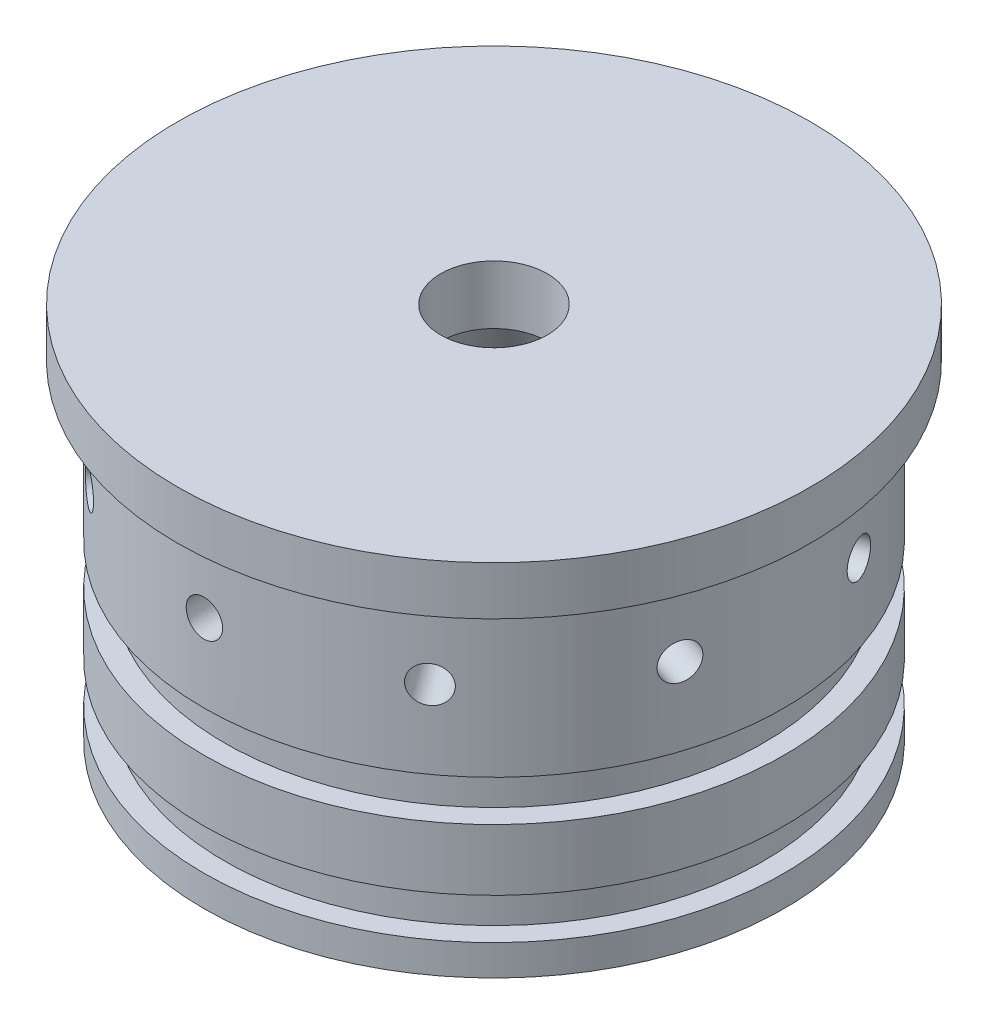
from build123d import *

# Parameters (mm, degrees)
SKETCH3_R          = 2.3749
CUT_EXTRUDE2_DEPTH = 12.7
CIRPATTERN1_COUNT  = 10


with BuildPart() as part:
    # Sketch1 → Revolve1 (revolve)
    with BuildSketch(Plane.XY, mode=Mode.PRIVATE) as revolve1_sk:
        Polygon((26.7335, 12.7), (26.7335, 0), (37.846, 0), (37.846, 4), (35.1282, 4), (35.1282, 9.334), (37.846, 9.334), (37.846, 13.334), (37.846, 17.334), (35.1282, 17.334), (35.1282, 22.668), (37.846, 22.668), (37.846, 42.988), (41.275, 42.988), (41.275, 49.338), (6.9453125, 49.338), (6.9453125, 41.695389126), (20.3835, 12.7), align=None)
    revolve(revolve1_sk.sketch.rotate(Axis((0, 0, 0), (0, 1, 0)), 90), axis=Axis((0, 0, 0), (0, 1, 0)))

    # Sketch3 → Cut-Extrude2 (cut)
    with BuildSketch(Plane.XY.offset(37.846)):
        with Locations((0, 32.828)):
            Circle(SKETCH3_R)
    cut_extrude2 = extrude(amount=-CUT_EXTRUDE2_DEPTH, mode=Mode.SUBTRACT)

    # CirPattern1: Cut-Extrude2 ×10 about axis
    cirpattern1_axis = Axis((0, 0, 0), (0, 1, 0))
    for i in range(1, CIRPATTERN1_COUNT):
        add(cut_extrude2.rotate(cirpattern1_axis, i * 360 / CIRPATTERN1_COUNT), mode=Mode.SUBTRACT)


solid = part.part
